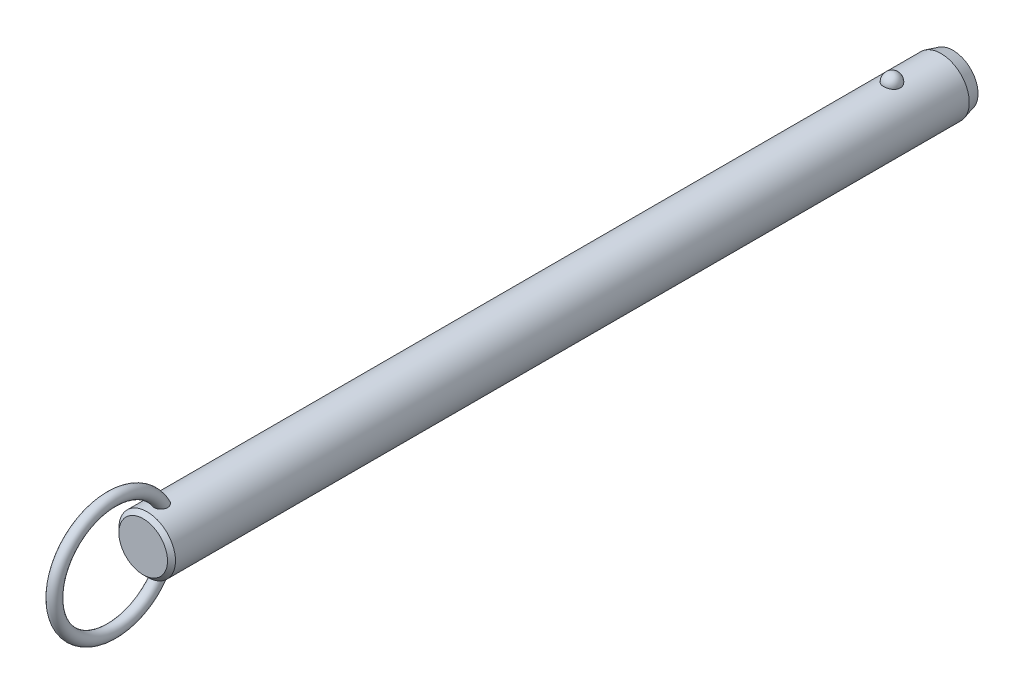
ISO-10303-21;
HEADER;
FILE_DESCRIPTION(('STEP AP214'),'2;1');
FILE_NAME('part.step','',(''),(''),'','','');
FILE_SCHEMA(('AUTOMOTIVE_DESIGN { 1 0 10303 214 1 1 1 1 }'));
ENDSEC;
DATA;
#1=APPLICATION_CONTEXT('core data for automotive mechanical design processes');
#2=APPLICATION_PROTOCOL_DEFINITION('international standard','automotive_design',2000,#1);
#3=PRODUCT_CONTEXT('',#1,'mechanical');
#4=PRODUCT('Part','Part','',(#3));
#5=PRODUCT_RELATED_PRODUCT_CATEGORY('part','',(#4));
#6=PRODUCT_DEFINITION_FORMATION('','',#4);
#7=PRODUCT_DEFINITION_CONTEXT('part definition',#1,'design');
#8=PRODUCT_DEFINITION('design','',#6,#7);
#9=PRODUCT_DEFINITION_SHAPE('','',#8);
#10=(LENGTH_UNIT() NAMED_UNIT(*) SI_UNIT(.MILLI.,.METRE.));
#11=(NAMED_UNIT(*) PLANE_ANGLE_UNIT() SI_UNIT($,.RADIAN.));
#12=(NAMED_UNIT(*) SI_UNIT($,.STERADIAN.) SOLID_ANGLE_UNIT());
#13=UNCERTAINTY_MEASURE_WITH_UNIT(LENGTH_MEASURE(1.E-05),#10,'distance_accuracy_value','');
#14=(GEOMETRIC_REPRESENTATION_CONTEXT(3) GLOBAL_UNCERTAINTY_ASSIGNED_CONTEXT((#13)) GLOBAL_UNIT_ASSIGNED_CONTEXT((#10,
#11,#12)) REPRESENTATION_CONTEXT('',''));
#15=CARTESIAN_POINT('',(0.,0.,0.));
#16=DIRECTION('',(0.,0.,1.));
#17=DIRECTION('',(1.,0.,0.));
#18=AXIS2_PLACEMENT_3D('',#15,#16,#17);
#19=CARTESIAN_POINT('',(0.,0.,177.8));
#20=DIRECTION('',(0.,0.,-1.));
#21=DIRECTION('',(-1.,0.,0.));
#22=AXIS2_PLACEMENT_3D('',#19,#20,#21);
#23=CYLINDRICAL_SURFACE('',#22,7.1);
#24=CARTESIAN_POINT('',(2.0769088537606,6.78943661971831,-2.1));
#25=CARTESIAN_POINT('',(2.07690739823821,6.78943796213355,-1.98268154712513));
#26=CARTESIAN_POINT('',(2.06738130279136,6.79237331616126,-1.86534506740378));
#27=CARTESIAN_POINT('',(2.0295040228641,6.8037853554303,-1.63400788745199));
#28=CARTESIAN_POINT('',(2.00114757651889,6.81226358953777,-1.52000812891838));
#29=CARTESIAN_POINT('',(1.92632025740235,6.83379798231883,-1.29863433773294));
#30=CARTESIAN_POINT('',(1.87985726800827,6.84685214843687,-1.19125744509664));
#31=CARTESIAN_POINT('',(1.76995205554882,6.87608091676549,-0.98604657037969));
#32=CARTESIAN_POINT('',(1.70650980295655,6.8922555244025,-0.88821260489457));
#33=CARTESIAN_POINT('',(1.5638119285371,6.92602930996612,-0.704242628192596));
#34=CARTESIAN_POINT('',(1.4844714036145,6.94363582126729,-0.618173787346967));
#35=CARTESIAN_POINT('',(1.31221746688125,6.97823658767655,-0.460740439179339));
#36=CARTESIAN_POINT('',(1.21930409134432,6.99523084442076,-0.389375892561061));
#37=CARTESIAN_POINT('',(1.02268781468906,7.02666176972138,-0.263547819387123));
#38=CARTESIAN_POINT('',(0.91902009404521,7.04110638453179,-0.209031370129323));
#39=CARTESIAN_POINT('',(0.703548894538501,7.06588726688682,-0.118163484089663));
#40=CARTESIAN_POINT('',(0.591746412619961,7.07622403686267,-0.0818098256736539));
#41=CARTESIAN_POINT('',(0.365557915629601,7.09147068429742,-0.0288711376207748));
#42=CARTESIAN_POINT('',(0.251267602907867,7.09648447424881,-0.0119070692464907));
#43=CARTESIAN_POINT('',(0.0213499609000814,7.10089837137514,0.00304925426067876));
#44=CARTESIAN_POINT('',(-0.0942772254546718,7.10029907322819,0.00104351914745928));
#45=CARTESIAN_POINT('',(-0.321651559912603,7.09360829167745,-0.0216931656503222));
#46=CARTESIAN_POINT('',(-0.433431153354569,7.08760388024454,-0.0421272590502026));
#47=CARTESIAN_POINT('',(-0.651862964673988,7.07086131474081,-0.100729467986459));
#48=CARTESIAN_POINT('',(-0.758515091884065,7.06012307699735,-0.138897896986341));
#49=CARTESIAN_POINT('',(-0.964449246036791,7.03496097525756,-0.232213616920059));
#50=CARTESIAN_POINT('',(-1.06368095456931,7.02051445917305,-0.287465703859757));
#51=CARTESIAN_POINT('',(-1.25145353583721,6.98948740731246,-0.413383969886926));
#52=CARTESIAN_POINT('',(-1.33999321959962,6.97290663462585,-0.48405186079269));
#53=CARTESIAN_POINT('',(-1.50591604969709,6.93898770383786,-0.640594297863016));
#54=CARTESIAN_POINT('',(-1.58302488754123,6.92164094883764,-0.726757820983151));
#55=CARTESIAN_POINT('',(-1.72189320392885,6.8884103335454,-0.91092752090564));
#56=CARTESIAN_POINT('',(-1.78365144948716,6.87252659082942,-1.008934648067));
#57=CARTESIAN_POINT('',(-1.89101272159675,6.84377189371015,-1.21549497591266));
#58=CARTESIAN_POINT('',(-1.93639553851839,6.83094274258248,-1.32416860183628));
#59=CARTESIAN_POINT('',(-2.00874275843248,6.81002070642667,-1.54791500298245));
#60=CARTESIAN_POINT('',(-2.03570774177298,6.80192767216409,-1.66298757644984));
#61=CARTESIAN_POINT('',(-2.07047276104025,6.7914266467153,-1.89571453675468));
#62=CARTESIAN_POINT('',(-2.07835878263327,6.78899315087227,-2.01335491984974));
#63=CARTESIAN_POINT('',(-2.07502083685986,6.79001409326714,-2.24833570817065));
#64=CARTESIAN_POINT('',(-2.06379746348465,6.7934683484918,-2.36567612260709));
#65=CARTESIAN_POINT('',(-2.02263913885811,6.80583442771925,-2.59603194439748));
#66=CARTESIAN_POINT('',(-1.99281127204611,6.81471501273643,-2.70906820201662));
#67=CARTESIAN_POINT('',(-1.91526639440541,6.83691232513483,-2.92836575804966));
#68=CARTESIAN_POINT('',(-1.8675486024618,6.85022924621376,-3.03462676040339));
#69=CARTESIAN_POINT('',(-1.75504492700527,6.87991336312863,-3.23806487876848));
#70=CARTESIAN_POINT('',(-1.69015924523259,6.89629822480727,-3.33518422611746));
#71=CARTESIAN_POINT('',(-1.54505404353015,6.93024852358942,-3.51697105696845));
#72=CARTESIAN_POINT('',(-1.46483385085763,6.94781401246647,-3.60163799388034));
#73=CARTESIAN_POINT('',(-1.29071406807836,6.98225977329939,-3.75654119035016));
#74=CARTESIAN_POINT('',(-1.19675650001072,6.99913673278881,-3.82671308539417));
#75=CARTESIAN_POINT('',(-0.997940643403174,7.03023618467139,-3.9501837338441));
#76=CARTESIAN_POINT('',(-0.89308318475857,7.04445887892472,-4.00348377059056));
#77=CARTESIAN_POINT('',(-0.676902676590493,7.06848365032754,-4.09107242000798));
#78=CARTESIAN_POINT('',(-0.565686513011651,7.0783430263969,-4.12560889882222));
#79=CARTESIAN_POINT('',(-0.338739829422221,7.09282534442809,-4.17575450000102));
#80=CARTESIAN_POINT('',(-0.223009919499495,7.09744899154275,-4.19136617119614));
#81=CARTESIAN_POINT('',(0.00707628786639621,7.10090930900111,-4.20307965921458));
#82=CARTESIAN_POINT('',(0.121410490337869,7.09986531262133,-4.19958377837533));
#83=CARTESIAN_POINT('',(0.347815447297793,7.092380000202,-4.17411564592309));
#84=CARTESIAN_POINT('',(0.459886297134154,7.08593891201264,-4.15214417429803));
#85=CARTESIAN_POINT('',(0.678084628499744,7.06838983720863,-4.09049562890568));
#86=CARTESIAN_POINT('',(0.784237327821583,7.05730369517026,-4.05090137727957));
#87=CARTESIAN_POINT('',(0.988305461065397,7.03163139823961,-3.95511447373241));
#88=CARTESIAN_POINT('',(1.08622031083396,7.01704499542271,-3.89892064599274));
#89=CARTESIAN_POINT('',(1.27284490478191,6.98562668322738,-3.77035541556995));
#90=CARTESIAN_POINT('',(1.36137372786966,6.96876135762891,-3.69772964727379));
#91=CARTESIAN_POINT('',(1.52509486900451,6.93477412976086,-3.53878279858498));
#92=CARTESIAN_POINT('',(1.60028496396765,6.91765218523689,-3.45245943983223));
#93=CARTESIAN_POINT('',(1.73681688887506,6.88465753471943,-3.26658774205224));
#94=CARTESIAN_POINT('',(1.79785966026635,6.86881574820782,-3.16681408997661));
#95=CARTESIAN_POINT('',(1.90265327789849,6.84053157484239,-2.95814408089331));
#96=CARTESIAN_POINT('',(1.94640861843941,6.82808830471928,-2.84925010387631));
#97=CARTESIAN_POINT('',(2.01274378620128,6.80881460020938,-2.63454318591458));
#98=CARTESIAN_POINT('',(2.03676193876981,6.80160856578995,-2.52920574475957));
#99=CARTESIAN_POINT('',(2.06884490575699,6.79191902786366,-2.3159172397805));
#100=CARTESIAN_POINT('',(2.07691019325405,6.78943538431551,-2.20796625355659));
#101=CARTESIAN_POINT('',(2.0769088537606,6.78943661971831,-2.1));
#102=B_SPLINE_CURVE_WITH_KNOTS('',3,(#24,#25,#26,#27,#28,#29,#30,#31,#32,#33,#34,#35,#36,#37,
#38,#39,#40,#41,#42,#43,#44,#45,#46,#47,#48,#49,#50,#51,#52,#53,#54,#55,#56,#57,#58,#59,#60,#61,
#62,#63,#64,#65,#66,#67,#68,#69,#70,#71,#72,#73,#74,#75,#76,#77,#78,#79,#80,#81,#82,#83,#84,#85,
#86,#87,#88,#89,#90,#91,#92,#93,#94,#95,#96,#97,#98,#99,#100,#101),.UNSPECIFIED.,.T.,.F.,(4,2,2,
2,2,2,2,2,2,2,2,2,2,2,2,2,2,2,2,2,2,2,2,2,2,2,2,2,2,2,2,2,2,2,2,2,2,2,4),(0.,0.351568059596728,
0.703234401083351,1.05474780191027,1.40626181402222,1.75970563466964,2.11314851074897,
2.4654696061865,2.81774759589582,3.16301449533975,3.50824481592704,3.84801136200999,
4.18778391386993,4.52968352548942,4.87162112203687,5.22076181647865,5.56993054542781,
5.92363364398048,6.27732559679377,6.62942052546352,6.98150450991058,7.33158042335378,
7.68167162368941,8.03384443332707,8.38603269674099,8.73975272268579,9.09344583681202,
9.44234545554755,9.79119807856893,10.1327344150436,10.4742563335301,10.8141898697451,
11.1541474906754,11.4997793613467,11.8454687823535,12.1979079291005,12.5502553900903,
12.8738073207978,13.1973496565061),.UNSPECIFIED.);
#103=CARTESIAN_POINT('',(2.0769088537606,6.78943661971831,-2.1));
#104=VERTEX_POINT('',#103);
#105=EDGE_CURVE('E41',#104,#104,#102,.T.);
#106=ORIENTED_EDGE('',*,*,#105,.T.);
#107=EDGE_LOOP('',(#106));
#108=FACE_BOUND('',#107,.T.);
#109=CARTESIAN_POINT('',(0.,0.,184.72));
#110=DIRECTION('',(0.,0.,1.));
#111=DIRECTION('',(1.,0.,0.));
#112=AXIS2_PLACEMENT_3D('',#109,#110,#111);
#113=CIRCLE('',#112,7.1);
#114=CARTESIAN_POINT('',(7.1,0.,184.72));
#115=VERTEX_POINT('',#114);
#116=EDGE_CURVE('E10',#115,#115,#113,.F.);
#117=ORIENTED_EDGE('',*,*,#116,.T.);
#118=EDGE_LOOP('',(#117));
#119=FACE_BOUND('',#118,.T.);
#120=CARTESIAN_POINT('',(-0.429539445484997,-7.08699541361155,179.542921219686));
#121=CARTESIAN_POINT('',(-0.508331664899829,-7.08221999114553,179.566876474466));
#122=CARTESIAN_POINT('',(-0.585039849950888,-7.07624016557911,179.597457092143));
#123=CARTESIAN_POINT('',(-0.732082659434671,-7.06254296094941,179.671024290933));
#124=CARTESIAN_POINT('',(-0.802417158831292,-7.05482554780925,179.714011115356));
#125=CARTESIAN_POINT('',(-0.934722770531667,-7.03851844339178,179.811113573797));
#126=CARTESIAN_POINT('',(-0.996700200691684,-7.02992941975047,179.865220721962));
#127=CARTESIAN_POINT('',(-1.11079942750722,-7.01280697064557,179.982967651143));
#128=CARTESIAN_POINT('',(-1.16292136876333,-7.00427354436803,180.046607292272));
#129=CARTESIAN_POINT('',(-1.25705660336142,-6.98799959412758,180.182687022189));
#130=CARTESIAN_POINT('',(-1.29888032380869,-6.98027525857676,180.255259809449));
#131=CARTESIAN_POINT('',(-1.37069920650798,-6.96652886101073,180.406168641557));
#132=CARTESIAN_POINT('',(-1.40069157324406,-6.96050720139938,180.484506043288));
#133=CARTESIAN_POINT('',(-1.45043507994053,-6.95031881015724,180.650190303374));
#134=CARTESIAN_POINT('',(-1.46937115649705,-6.94630231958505,180.737789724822));
#135=CARTESIAN_POINT('',(-1.49424917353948,-6.94099239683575,180.914871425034));
#136=CARTESIAN_POINT('',(-1.50018601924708,-6.93970003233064,181.004354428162));
#137=CARTESIAN_POINT('',(-1.49978214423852,-6.93978815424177,181.194060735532));
#138=CARTESIAN_POINT('',(-1.49187639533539,-6.94150934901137,181.294279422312));
#139=CARTESIAN_POINT('',(-1.46177925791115,-6.94790814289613,181.492479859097));
#140=CARTESIAN_POINT('',(-1.43957541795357,-6.95258831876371,181.590459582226));
#141=CARTESIAN_POINT('',(-1.37783293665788,-6.96510647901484,181.79536292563));
#142=CARTESIAN_POINT('',(-1.33634073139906,-6.97328848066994,181.901680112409));
#143=CARTESIAN_POINT('',(-1.23686994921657,-6.99161706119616,182.106177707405));
#144=CARTESIAN_POINT('',(-1.17889192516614,-7.00176357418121,182.204358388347));
#145=CARTESIAN_POINT('',(-1.0587512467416,-7.02082898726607,182.372374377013));
#146=CARTESIAN_POINT('',(-0.999247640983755,-7.02963746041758,182.444123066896));
#147=CARTESIAN_POINT('',(-0.869494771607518,-7.04686074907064,182.577195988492));
#148=CARTESIAN_POINT('',(-0.799263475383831,-7.05527619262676,182.638537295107));
#149=CARTESIAN_POINT('',(-0.665408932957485,-7.06899457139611,182.735131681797));
#150=CARTESIAN_POINT('',(-0.603817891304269,-7.07457275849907,182.773151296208));
#151=CARTESIAN_POINT('',(-0.475172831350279,-7.08437420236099,182.838758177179));
#152=CARTESIAN_POINT('',(-0.408123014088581,-7.08859848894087,182.866353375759));
#153=CARTESIAN_POINT('',(-0.269431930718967,-7.09522749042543,182.909256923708));
#154=CARTESIAN_POINT('',(-0.197757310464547,-7.09761688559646,182.924461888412));
#155=CARTESIAN_POINT('',(-0.0527849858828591,-7.10017268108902,182.940716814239));
#156=CARTESIAN_POINT('',(0.0205115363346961,-7.10034065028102,182.941776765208));
#157=CARTESIAN_POINT('',(0.15642613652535,-7.09855986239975,182.930461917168));
#158=CARTESIAN_POINT('',(0.219199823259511,-7.09688191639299,182.919806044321));
#159=CARTESIAN_POINT('',(0.342134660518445,-7.09201880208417,182.888537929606));
#160=CARTESIAN_POINT('',(0.402295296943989,-7.08883333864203,182.867923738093));
#161=CARTESIAN_POINT('',(0.520687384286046,-7.08113868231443,182.817212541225));
#162=CARTESIAN_POINT('',(0.578791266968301,-7.07658958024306,182.786827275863));
#163=CARTESIAN_POINT('',(0.690173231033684,-7.06659708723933,182.718367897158));
#164=CARTESIAN_POINT('',(0.743447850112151,-7.061153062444,182.680288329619));
#165=CARTESIAN_POINT('',(0.870947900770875,-7.04680292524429,182.576592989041));
#166=CARTESIAN_POINT('',(0.941828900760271,-7.03755800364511,182.506897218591));
#167=CARTESIAN_POINT('',(1.07136606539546,-7.01900793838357,182.356945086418));
#168=CARTESIAN_POINT('',(1.13000013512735,-7.00970271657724,182.276670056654));
#169=CARTESIAN_POINT('',(1.23579584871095,-6.99183327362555,182.106899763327));
#170=CARTESIAN_POINT('',(1.28274271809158,-6.98328455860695,182.017269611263));
#171=CARTESIAN_POINT('',(1.36351442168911,-6.96796352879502,181.832176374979));
#172=CARTESIAN_POINT('',(1.39733971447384,-6.96119115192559,181.736713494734));
#173=CARTESIAN_POINT('',(1.45579181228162,-6.94922464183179,181.52530928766));
#174=CARTESIAN_POINT('',(1.47790145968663,-6.94449000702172,181.408631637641));
#175=CARTESIAN_POINT('',(1.50168752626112,-6.93938731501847,181.173015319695));
#176=CARTESIAN_POINT('',(1.50336085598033,-6.93901991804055,181.05407631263));
#177=CARTESIAN_POINT('',(1.48486516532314,-6.9430010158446,180.82360799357));
#178=CARTESIAN_POINT('',(1.46573441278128,-6.9471253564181,180.711995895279));
#179=CARTESIAN_POINT('',(1.40606892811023,-6.95944667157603,180.494886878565));
#180=CARTESIAN_POINT('',(1.36556446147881,-6.96763788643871,180.3893815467));
#181=CARTESIAN_POINT('',(1.27082700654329,-6.98548038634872,180.204287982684));
#182=CARTESIAN_POINT('',(1.21949810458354,-6.99473841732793,180.123171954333));
#183=CARTESIAN_POINT('',(1.10242050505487,-7.01414069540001,179.972227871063));
#184=CARTESIAN_POINT('',(1.03668119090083,-7.02428436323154,179.90239252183));
#185=CARTESIAN_POINT('',(0.90055902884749,-7.04295285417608,179.783573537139));
#186=CARTESIAN_POINT('',(0.831428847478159,-7.05153466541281,179.733157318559));
#187=CARTESIAN_POINT('',(0.685291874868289,-7.06723150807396,179.645142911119));
#188=CARTESIAN_POINT('',(0.608287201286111,-7.0743469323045,179.607541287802));
#189=CARTESIAN_POINT('',(0.451878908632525,-7.08602232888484,179.547491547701));
#190=CARTESIAN_POINT('',(0.372686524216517,-7.09067127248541,179.524508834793));
#191=CARTESIAN_POINT('',(0.211477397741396,-7.09730788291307,179.492035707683));
#192=CARTESIAN_POINT('',(0.12946098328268,-7.09929585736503,179.48254373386));
#193=CARTESIAN_POINT('',(-0.0332905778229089,-7.10037858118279,179.477351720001));
#194=CARTESIAN_POINT('',(-0.114016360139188,-7.09953334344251,179.481365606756));
#195=CARTESIAN_POINT('',(-0.273670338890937,-7.09517338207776,179.502454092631));
#196=CARTESIAN_POINT('',(-0.352598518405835,-7.09165863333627,179.519528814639));
#197=CARTESIAN_POINT('',(-0.429539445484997,-7.08699541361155,179.542921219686));
#198=B_SPLINE_CURVE_WITH_KNOTS('',3,(#120,#121,#122,#123,#124,#125,#126,#127,#128,#129,#130,
#131,#132,#133,#134,#135,#136,#137,#138,#139,#140,#141,#142,#143,#144,#145,#146,#147,#148,#149,
#150,#151,#152,#153,#154,#155,#156,#157,#158,#159,#160,#161,#162,#163,#164,#165,#166,#167,#168,
#169,#170,#171,#172,#173,#174,#175,#176,#177,#178,#179,#180,#181,#182,#183,#184,#185,#186,#187,
#188,#189,#190,#191,#192,#193,#194,#195,#196,#197),.UNSPECIFIED.,.T.,.F.,(4,2,2,2,2,2,2,2,2,2,2,
2,2,2,2,2,2,2,2,2,2,2,2,2,2,2,2,2,2,2,2,2,2,2,2,2,2,2,4),(0.,0.247183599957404,
0.494372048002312,0.741372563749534,0.988369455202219,1.23962059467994,1.490931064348,
1.75897818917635,2.02713035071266,2.3275826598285,2.62829697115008,2.97008736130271,
3.31186629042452,3.59175319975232,3.87117637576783,4.08813841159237,4.30493502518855,
4.52352259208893,4.74195577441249,4.93215328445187,5.12238804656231,5.31884850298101,
5.51544871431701,5.81332317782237,6.11173048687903,6.41527266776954,6.71880423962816,
7.07358156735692,7.42841252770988,7.76631485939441,8.10373999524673,8.39142246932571,
8.67891817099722,8.9356033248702,9.19221962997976,9.43881106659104,9.68537399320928,
9.92674752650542,10.1681233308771),.UNSPECIFIED.);
#199=CARTESIAN_POINT('',(-0.429539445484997,-7.08699541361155,179.542921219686));
#200=VERTEX_POINT('',#199);
#201=EDGE_CURVE('E59',#200,#200,#198,.T.);
#202=ORIENTED_EDGE('',*,*,#201,.T.);
#203=EDGE_LOOP('',(#202));
#204=FACE_BOUND('',#203,.T.);
#205=CARTESIAN_POINT('',(-0.429539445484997,7.08699541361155,179.542921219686));
#206=CARTESIAN_POINT('',(-0.351665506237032,7.09171429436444,179.519246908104));
#207=CARTESIAN_POINT('',(-0.271733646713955,7.09525896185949,179.502036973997));
#208=CARTESIAN_POINT('',(-0.110026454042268,7.09960839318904,179.481005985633));
#209=CARTESIAN_POINT('',(-0.0282502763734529,7.10041187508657,179.477191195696));
#210=CARTESIAN_POINT('',(0.134782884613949,7.09918849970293,179.483059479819));
#211=CARTESIAN_POINT('',(0.216039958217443,7.09716214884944,179.49274013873));
#212=CARTESIAN_POINT('',(0.375730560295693,7.09050177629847,179.525347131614));
#213=CARTESIAN_POINT('',(0.454164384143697,7.08586802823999,179.548272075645));
#214=CARTESIAN_POINT('',(0.60602533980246,7.07449911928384,179.606771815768));
#215=CARTESIAN_POINT('',(0.679451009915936,7.06776334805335,179.642350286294));
#216=CARTESIAN_POINT('',(0.81923414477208,7.05292866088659,179.725175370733));
#217=CARTESIAN_POINT('',(0.885591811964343,7.04482978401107,179.772421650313));
#218=CARTESIAN_POINT('',(1.00993211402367,7.02808709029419,179.877590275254));
#219=CARTESIAN_POINT('',(1.06785399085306,7.01943990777,179.935583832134));
#220=CARTESIAN_POINT('',(1.17342527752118,7.00256662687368,180.060301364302));
#221=CARTESIAN_POINT('',(1.22107408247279,6.99434055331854,180.127025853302));
#222=CARTESIAN_POINT('',(1.30652927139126,6.97889183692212,180.269362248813));
#223=CARTESIAN_POINT('',(1.34399711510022,6.97170674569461,180.345180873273));
#224=CARTESIAN_POINT('',(1.40682616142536,6.95930080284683,180.501810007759));
#225=CARTESIAN_POINT('',(1.43218374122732,6.95408053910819,180.58262200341));
#226=CARTESIAN_POINT('',(1.47246409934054,6.94566853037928,180.753531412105));
#227=CARTESIAN_POINT('',(1.48642590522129,6.9426653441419,180.84386307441));
#228=CARTESIAN_POINT('',(1.5011410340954,6.93949744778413,181.025619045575));
#229=CARTESIAN_POINT('',(1.50188917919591,6.93933385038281,181.117043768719));
#230=CARTESIAN_POINT('',(1.49030464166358,6.94183245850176,181.31084381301));
#231=CARTESIAN_POINT('',(1.47627413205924,6.94486147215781,181.413112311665));
#232=CARTESIAN_POINT('',(1.43356351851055,6.95380194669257,181.614471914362));
#233=CARTESIAN_POINT('',(1.4048676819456,6.95971650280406,181.713559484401));
#234=CARTESIAN_POINT('',(1.32908750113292,6.97461208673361,181.918908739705));
#235=CARTESIAN_POINT('',(1.28011435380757,6.98388945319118,182.024456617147));
#236=CARTESIAN_POINT('',(1.16520357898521,7.00397743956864,182.225760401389));
#237=CARTESIAN_POINT('',(1.09927694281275,7.01478706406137,182.321522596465));
#238=CARTESIAN_POINT('',(0.969361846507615,7.03373936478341,182.476756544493));
#239=CARTESIAN_POINT('',(0.909042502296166,7.04187023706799,182.539303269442));
#240=CARTESIAN_POINT('',(0.77917855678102,7.05741732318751,182.654053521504));
#241=CARTESIAN_POINT('',(0.709649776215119,7.06483472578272,182.706274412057));
#242=CARTESIAN_POINT('',(0.576854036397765,7.0767751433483,182.788113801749));
#243=CARTESIAN_POINT('',(0.515118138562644,7.08158033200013,182.820164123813));
#244=CARTESIAN_POINT('',(0.387127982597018,7.08972701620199,182.873765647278));
#245=CARTESIAN_POINT('',(0.320877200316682,7.09306962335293,182.895324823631));
#246=CARTESIAN_POINT('',(0.185041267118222,7.09791507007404,182.926400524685));
#247=CARTESIAN_POINT('',(0.115437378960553,7.09940591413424,182.935838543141));
#248=CARTESIAN_POINT('',(-0.0243157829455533,7.10030171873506,182.941522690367));
#249=CARTESIAN_POINT('',(-0.0944648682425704,7.0997073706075,182.937773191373));
#250=CARTESIAN_POINT('',(-0.225713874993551,7.09668414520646,182.918508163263));
#251=CARTESIAN_POINT('',(-0.28700675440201,7.09444865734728,182.904232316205));
#252=CARTESIAN_POINT('',(-0.406555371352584,7.08860360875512,182.866368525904));
#253=CARTESIAN_POINT('',(-0.46480981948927,7.08499346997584,182.842776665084));
#254=CARTESIAN_POINT('',(-0.594955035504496,7.07541654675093,182.778923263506));
#255=CARTESIAN_POINT('',(-0.665389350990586,7.06906574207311,182.735753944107));
#256=CARTESIAN_POINT('',(-0.798242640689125,7.05530261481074,182.638587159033));
#257=CARTESIAN_POINT('',(-0.860645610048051,7.0478882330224,182.584568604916));
#258=CARTESIAN_POINT('',(-0.994249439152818,7.03045217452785,182.450996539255));
#259=CARTESIAN_POINT('',(-1.06260129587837,7.02030745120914,182.368614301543));
#260=CARTESIAN_POINT('',(-1.18502045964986,7.00068382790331,182.193843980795));
#261=CARTESIAN_POINT('',(-1.23907684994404,6.99120544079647,182.101448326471));
#262=CARTESIAN_POINT('',(-1.33335589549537,6.97384343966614,181.908008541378));
#263=CARTESIAN_POINT('',(-1.37336138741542,6.96598557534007,181.806856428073));
#264=CARTESIAN_POINT('',(-1.43770677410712,6.95299053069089,181.599504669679));
#265=CARTESIAN_POINT('',(-1.46204473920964,6.94785368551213,181.49330440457));
#266=CARTESIAN_POINT('',(-1.49537533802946,6.94076296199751,181.268231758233));
#267=CARTESIAN_POINT('',(-1.50273564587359,6.93914842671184,181.14909751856));
#268=CARTESIAN_POINT('',(-1.49545550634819,6.94072368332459,180.911470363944));
#269=CARTESIAN_POINT('',(-1.48082914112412,6.94391040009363,180.792977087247));
#270=CARTESIAN_POINT('',(-1.43076401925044,6.95438579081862,180.573432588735));
#271=CARTESIAN_POINT('',(-1.3976222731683,6.96121852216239,180.471841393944));
#272=CARTESIAN_POINT('',(-1.31211274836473,6.97783941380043,180.277351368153));
#273=CARTESIAN_POINT('',(-1.25976607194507,6.98762432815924,180.18444313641));
#274=CARTESIAN_POINT('',(-1.14583073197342,7.00713153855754,180.024160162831));
#275=CARTESIAN_POINT('',(-1.08665947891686,7.01665982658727,179.955035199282));
#276=CARTESIAN_POINT('',(-0.956606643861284,7.03556646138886,179.828878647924));
#277=CARTESIAN_POINT('',(-0.88573712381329,7.04494495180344,179.771834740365));
#278=CARTESIAN_POINT('',(-0.7515580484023,7.06035735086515,179.683100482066));
#279=CARTESIAN_POINT('',(-0.690120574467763,7.0666695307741,179.648593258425));
#280=CARTESIAN_POINT('',(-0.562815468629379,7.07794609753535,179.588750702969));
#281=CARTESIAN_POINT('',(-0.496948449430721,7.08291067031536,179.563414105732));
#282=CARTESIAN_POINT('',(-0.429539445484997,7.08699541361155,179.542921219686));
#283=B_SPLINE_CURVE_WITH_KNOTS('',3,(#205,#206,#207,#208,#209,#210,#211,#212,#213,#214,#215,
#216,#217,#218,#219,#220,#221,#222,#223,#224,#225,#226,#227,#228,#229,#230,#231,#232,#233,#234,
#235,#236,#237,#238,#239,#240,#241,#242,#243,#244,#245,#246,#247,#248,#249,#250,#251,#252,#253,
#254,#255,#256,#257,#258,#259,#260,#261,#262,#263,#264,#265,#266,#267,#268,#269,#270,#271,#272,
#273,#274,#275,#276,#277,#278,#279,#280,#281,#282),.UNSPECIFIED.,.T.,.F.,(4,2,2,2,2,2,2,2,2,2,2,
2,2,2,2,2,2,2,2,2,2,2,2,2,2,2,2,2,2,2,2,2,2,2,2,2,2,2,4),(0.,0.244335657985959,0.48878556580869,
0.733191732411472,0.977572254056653,1.22202379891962,1.46646834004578,1.71259457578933,
1.9587352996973,2.21226768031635,2.46587585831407,2.73913816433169,3.01250754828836,
3.32109936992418,3.63002293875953,3.9786351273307,4.32702187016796,4.58793945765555,
4.84841449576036,5.05676704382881,5.26496096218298,5.47449661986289,5.68396281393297,
5.87205447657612,6.06022532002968,6.30743751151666,6.55513496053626,6.87602468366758,
7.19715875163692,7.5230577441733,7.84899686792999,8.20516155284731,8.56109821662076,
8.88040084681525,9.1993536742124,9.47236282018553,9.74509220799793,9.95662250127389,
10.1681235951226),.UNSPECIFIED.);
#284=CARTESIAN_POINT('',(-0.429539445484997,7.08699541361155,179.542921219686));
#285=VERTEX_POINT('',#284);
#286=EDGE_CURVE('E67',#285,#285,#283,.T.);
#287=ORIENTED_EDGE('',*,*,#286,.T.);
#288=EDGE_LOOP('',(#287));
#289=FACE_BOUND('',#288,.T.);
#290=CARTESIAN_POINT('',(0.,0.,-14.3999999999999));
#291=DIRECTION('',(0.,0.,-1.));
#292=DIRECTION('',(-1.,0.,0.));
#293=AXIS2_PLACEMENT_3D('',#290,#291,#292);
#294=CIRCLE('',#293,7.1);
#295=CARTESIAN_POINT('',(-7.1,0.,-14.3999999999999));
#296=VERTEX_POINT('',#295);
#297=EDGE_CURVE('E56',#296,#296,#294,.F.);
#298=ORIENTED_EDGE('',*,*,#297,.T.);
#299=EDGE_LOOP('',(#298));
#300=FACE_BOUND('',#299,.T.);
#301=ADVANCED_FACE('F37',(#108,#119,#204,#289,#300),#23,.T.);
#302=CARTESIAN_POINT('',(0.,0.,-17.4));
#303=DIRECTION('',(0.,0.,-1.));
#304=DIRECTION('',(-1.,0.,0.));
#305=AXIS2_PLACEMENT_3D('',#302,#303,#304);
#306=PLANE('',#305);
#307=CARTESIAN_POINT('',(0.,0.,-17.4));
#308=DIRECTION('',(0.,0.,-1.));
#309=DIRECTION('',(-1.,0.,0.));
#310=AXIS2_PLACEMENT_3D('',#307,#308,#309);
#311=CIRCLE('',#310,6.29615242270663);
#312=CARTESIAN_POINT('',(-6.29615242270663,0.,-17.4));
#313=VERTEX_POINT('',#312);
#314=EDGE_CURVE('E66',#313,#313,#311,.T.);
#315=ORIENTED_EDGE('',*,*,#314,.T.);
#316=EDGE_LOOP('',(#315));
#317=FACE_BOUND('',#316,.T.);
#318=ADVANCED_FACE('F85',(#317),#306,.T.);
#319=CARTESIAN_POINT('',(0.,0.,-17.4));
#320=DIRECTION('',(0.,0.,1.));
#321=DIRECTION('',(1.,0.,0.));
#322=AXIS2_PLACEMENT_3D('',#319,#320,#321);
#323=CONICAL_SURFACE('',#322,6.29615242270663,0.261799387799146);
#324=ORIENTED_EDGE('',*,*,#297,.F.);
#325=EDGE_LOOP('',(#324));
#326=FACE_BOUND('',#325,.T.);
#327=ORIENTED_EDGE('',*,*,#314,.F.);
#328=EDGE_LOOP('',(#327));
#329=FACE_BOUND('',#328,.T.);
#330=ADVANCED_FACE('F83',(#326,#329),#323,.T.);
#331=CARTESIAN_POINT('',(0.,0.,185.72));
#332=DIRECTION('',(0.,0.,1.));
#333=DIRECTION('',(1.,0.,0.));
#334=AXIS2_PLACEMENT_3D('',#331,#332,#333);
#335=PLANE('',#334);
#336=CARTESIAN_POINT('',(0.,0.,185.72));
#337=DIRECTION('',(0.,0.,1.));
#338=DIRECTION('',(1.,0.,0.));
#339=AXIS2_PLACEMENT_3D('',#336,#337,#338);
#340=CIRCLE('',#339,6.10000000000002);
#341=CARTESIAN_POINT('',(6.10000000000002,0.,185.72));
#342=VERTEX_POINT('',#341);
#343=EDGE_CURVE('E50',#342,#342,#340,.T.);
#344=ORIENTED_EDGE('',*,*,#343,.T.);
#345=EDGE_LOOP('',(#344));
#346=FACE_BOUND('',#345,.T.);
#347=ADVANCED_FACE('F77',(#346),#335,.T.);
#348=CARTESIAN_POINT('',(0.,0.,193.65));
#349=DIRECTION('',(1.,0.,0.));
#350=DIRECTION('',(0.,0.,-1.));
#351=AXIS2_PLACEMENT_3D('',#348,#349,#350);
#352=TOROIDAL_SURFACE('',#351,14.35,1.5);
#353=ORIENTED_EDGE('',*,*,#286,.F.);
#354=EDGE_LOOP('',(#353));
#355=FACE_BOUND('',#354,.T.);
#356=ORIENTED_EDGE('',*,*,#201,.F.);
#357=EDGE_LOOP('',(#356));
#358=FACE_BOUND('',#357,.T.);
#359=ADVANCED_FACE('F73',(#355,#358),#352,.T.);
#360=CARTESIAN_POINT('',(0.,0.,185.72));
#361=DIRECTION('',(0.,0.,-1.));
#362=DIRECTION('',(-1.,0.,0.));
#363=AXIS2_PLACEMENT_3D('',#360,#361,#362);
#364=CONICAL_SURFACE('',#363,6.10000000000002,0.785398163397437);
#365=ORIENTED_EDGE('',*,*,#116,.F.);
#366=EDGE_LOOP('',(#365));
#367=FACE_BOUND('',#366,.T.);
#368=ORIENTED_EDGE('',*,*,#343,.F.);
#369=EDGE_LOOP('',(#368));
#370=FACE_BOUND('',#369,.T.);
#371=ADVANCED_FACE('F39',(#367,#370),#364,.T.);
#372=CARTESIAN_POINT('',(0.,7.1,-2.1));
#373=DIRECTION('',(0.,1.,0.));
#374=DIRECTION('',(0.,0.,1.));
#375=AXIS2_PLACEMENT_3D('',#372,#373,#374);
#376=SPHERICAL_SURFACE('',#375,2.10000000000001);
#377=ORIENTED_EDGE('',*,*,#105,.F.);
#378=EDGE_LOOP('',(#377));
#379=FACE_BOUND('',#378,.T.);
#380=ADVANCED_FACE('F79',(#379),#376,.T.);
#381=CLOSED_SHELL('',(#301,#318,#330,#347,#359,#371,#380));
#382=MANIFOLD_SOLID_BREP('B2',#381);
#383=ADVANCED_BREP_SHAPE_REPRESENTATION('',(#18,#382),#14);
#384=SHAPE_DEFINITION_REPRESENTATION(#9,#383);
ENDSEC;
END-ISO-10303-21;
